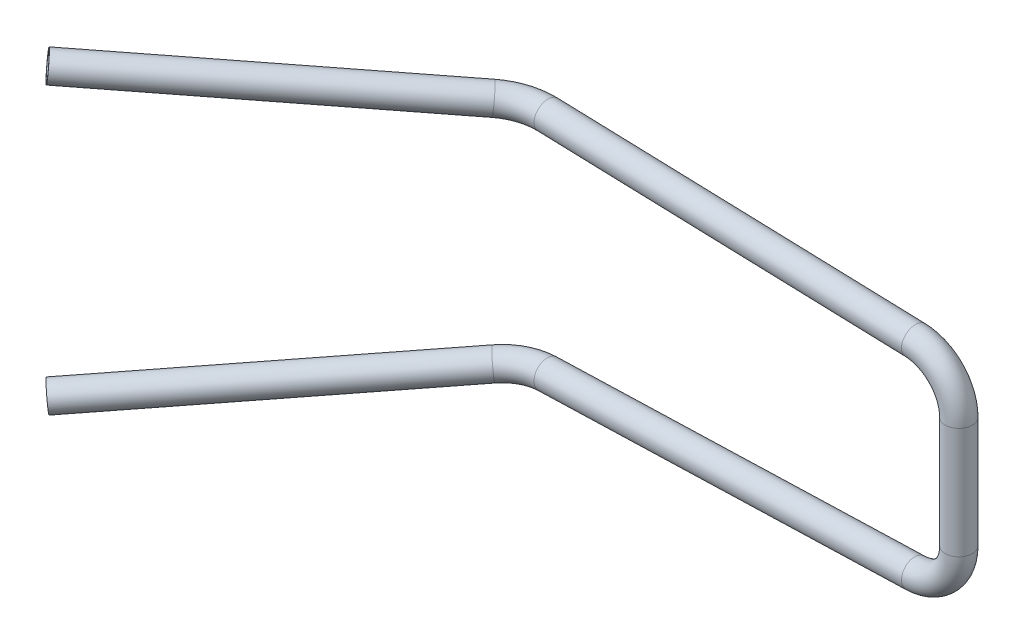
ISO-10303-21;
HEADER;
FILE_DESCRIPTION(('STEP AP214'),'2;1');
FILE_NAME('part.step','',(''),(''),'','','');
FILE_SCHEMA(('AUTOMOTIVE_DESIGN { 1 0 10303 214 1 1 1 1 }'));
ENDSEC;
DATA;
#1=APPLICATION_CONTEXT('core data for automotive mechanical design processes');
#2=APPLICATION_PROTOCOL_DEFINITION('international standard','automotive_design',2000,#1);
#3=PRODUCT_CONTEXT('',#1,'mechanical');
#4=PRODUCT('Part','Part','',(#3));
#5=PRODUCT_RELATED_PRODUCT_CATEGORY('part','',(#4));
#6=PRODUCT_DEFINITION_FORMATION('','',#4);
#7=PRODUCT_DEFINITION_CONTEXT('part definition',#1,'design');
#8=PRODUCT_DEFINITION('design','',#6,#7);
#9=PRODUCT_DEFINITION_SHAPE('','',#8);
#10=(LENGTH_UNIT() NAMED_UNIT(*) SI_UNIT(.MILLI.,.METRE.));
#11=(NAMED_UNIT(*) PLANE_ANGLE_UNIT() SI_UNIT($,.RADIAN.));
#12=(NAMED_UNIT(*) SI_UNIT($,.STERADIAN.) SOLID_ANGLE_UNIT());
#13=UNCERTAINTY_MEASURE_WITH_UNIT(LENGTH_MEASURE(1.E-05),#10,'distance_accuracy_value','');
#14=(GEOMETRIC_REPRESENTATION_CONTEXT(3) GLOBAL_UNCERTAINTY_ASSIGNED_CONTEXT((#13)) GLOBAL_UNIT_ASSIGNED_CONTEXT((#10,
#11,#12)) REPRESENTATION_CONTEXT('',''));
#15=CARTESIAN_POINT('',(0.,0.,0.));
#16=DIRECTION('',(0.,0.,1.));
#17=DIRECTION('',(1.,0.,0.));
#18=AXIS2_PLACEMENT_3D('',#15,#16,#17);
#19=CARTESIAN_POINT('',(-497.278865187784,-127.193748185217,17.4946720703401));
#20=DIRECTION('',(-0.704720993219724,-0.0882746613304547,0.703971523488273));
#21=DIRECTION('',(0.706730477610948,0.,0.707482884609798));
#22=AXIS2_PLACEMENT_3D('',#19,#20,#21);
#23=CYLINDRICAL_SURFACE('',#22,15.);
#24=CARTESIAN_POINT('',(-497.278865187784,-127.193748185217,17.4946720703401));
#25=DIRECTION('',(0.704720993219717,0.088274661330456,-0.703971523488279));
#26=DIRECTION('',(0.702774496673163,0.0492883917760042,0.709703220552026));
#27=AXIS2_PLACEMENT_3D('',#24,#25,#26);
#28=CIRCLE('',#27,15.);
#29=CARTESIAN_POINT('',(-507.910895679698,-126.532460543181,6.93424469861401));
#30=VERTEX_POINT('',#29);
#31=EDGE_CURVE('E39',#30,#30,#28,.T.);
#32=ORIENTED_EDGE('',*,*,#31,.F.);
#33=EDGE_LOOP('',(#32));
#34=FACE_BOUND('',#33,.T.);
#35=CARTESIAN_POINT('',(-743.931212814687,-158.089879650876,263.884705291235));
#36=DIRECTION('',(0.704720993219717,0.088274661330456,-0.703971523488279));
#37=DIRECTION('',(0.702774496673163,0.0492883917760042,0.709703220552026));
#38=AXIS2_PLACEMENT_3D('',#35,#36,#37);
#39=CIRCLE('',#38,15.);
#40=CARTESIAN_POINT('',(-733.389595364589,-157.350553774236,274.530253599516));
#41=VERTEX_POINT('',#40);
#42=EDGE_CURVE('E10',#41,#41,#39,.T.);
#43=ORIENTED_EDGE('',*,*,#42,.T.);
#44=EDGE_LOOP('',(#43));
#45=FACE_BOUND('',#44,.T.);
#46=ADVANCED_FACE('F29',(#34,#45),#23,.T.);
#47=CARTESIAN_POINT('',(-497.278865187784,-127.193748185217,17.4946720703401));
#48=DIRECTION('',(-0.704720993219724,-0.0882746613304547,0.703971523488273));
#49=DIRECTION('',(0.706730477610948,0.,0.707482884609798));
#50=AXIS2_PLACEMENT_3D('',#47,#48,#49);
#51=CYLINDRICAL_SURFACE('',#50,13.);
#52=CARTESIAN_POINT('',(-497.278865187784,-127.193748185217,17.4946720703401));
#53=DIRECTION('',(0.704720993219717,0.088274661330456,-0.703971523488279));
#54=DIRECTION('',(0.702774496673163,0.0492883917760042,0.709703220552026));
#55=AXIS2_PLACEMENT_3D('',#52,#53,#54);
#56=CIRCLE('',#55,13.);
#57=CARTESIAN_POINT('',(-506.493291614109,-126.620632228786,8.34230168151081));
#58=VERTEX_POINT('',#57);
#59=EDGE_CURVE('E43',#58,#58,#56,.T.);
#60=ORIENTED_EDGE('',*,*,#59,.T.);
#61=EDGE_LOOP('',(#60));
#62=FACE_BOUND('',#61,.T.);
#63=CARTESIAN_POINT('',(-743.931212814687,-158.089879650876,263.884705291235));
#64=DIRECTION('',(0.704720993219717,0.088274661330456,-0.703971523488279));
#65=DIRECTION('',(0.702774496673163,0.0492883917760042,0.709703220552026));
#66=AXIS2_PLACEMENT_3D('',#63,#64,#65);
#67=CIRCLE('',#66,13.);
#68=CARTESIAN_POINT('',(-734.795144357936,-157.449130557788,273.110847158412));
#69=VERTEX_POINT('',#68);
#70=EDGE_CURVE('E35',#69,#69,#67,.T.);
#71=ORIENTED_EDGE('',*,*,#70,.F.);
#72=EDGE_LOOP('',(#71));
#73=FACE_BOUND('',#72,.T.);
#74=ADVANCED_FACE('F143',(#62,#73),#51,.F.);
#75=CARTESIAN_POINT('',(-454.750743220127,-129.838898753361,59.7363815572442));
#76=DIRECTION('',(-0.031112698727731,0.995120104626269,0.0936374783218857));
#77=DIRECTION('',(0.,-0.0936828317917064,0.995602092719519));
#78=AXIS2_PLACEMENT_3D('',#75,#76,#77);
#79=TOROIDAL_SURFACE('',#78,60.,15.);
#80=CARTESIAN_POINT('',(-454.926313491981,-124.22339400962,0.));
#81=DIRECTION('',(0.999511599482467,0.0312500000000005,0.));
#82=DIRECTION('',(0.,0.,1.));
#83=AXIS2_PLACEMENT_3D('',#80,#81,#82);
#84=CIRCLE('',#83,15.);
#85=CARTESIAN_POINT('',(-454.970206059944,-122.819517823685,-14.9340953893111));
#86=VERTEX_POINT('',#85);
#87=EDGE_CURVE('E48',#86,#86,#84,.T.);
#88=CARTESIAN_POINT('',(-454.750743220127,-129.838898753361,59.7363815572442));
#89=DIRECTION('',(-0.031112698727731,0.995120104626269,0.0936374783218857));
#90=DIRECTION('',(0.,-0.0936828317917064,0.995602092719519));
#91=AXIS2_PLACEMENT_3D('',#88,#89,#90);
#92=CIRCLE('',#91,75.);
#93=EDGE_CURVE('',#86,#30,#92,.T.);
#94=ORIENTED_EDGE('',*,*,#87,.F.);
#95=ORIENTED_EDGE('',*,*,#31,.T.);
#96=ORIENTED_EDGE('',*,*,#93,.T.);
#97=ORIENTED_EDGE('',*,*,#93,.F.);
#98=EDGE_LOOP('',(#94,#96,#95,#97));
#99=FACE_BOUND('',#98,.T.);
#100=ADVANCED_FACE('F148',(#99),#79,.T.);
#101=CARTESIAN_POINT('',(-454.750743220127,-129.838898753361,59.7363815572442));
#102=DIRECTION('',(-0.031112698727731,0.995120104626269,0.0936374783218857));
#103=DIRECTION('',(0.,-0.0936828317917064,0.995602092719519));
#104=AXIS2_PLACEMENT_3D('',#101,#102,#103);
#105=TOROIDAL_SURFACE('',#104,60.,13.);
#106=CARTESIAN_POINT('',(-454.926313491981,-124.22339400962,0.));
#107=DIRECTION('',(0.999511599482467,0.0312500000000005,0.));
#108=DIRECTION('',(0.,0.,1.));
#109=AXIS2_PLACEMENT_3D('',#106,#107,#108);
#110=CIRCLE('',#109,13.);
#111=CARTESIAN_POINT('',(-454.964353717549,-123.006701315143,-12.9428826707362));
#112=VERTEX_POINT('',#111);
#113=EDGE_CURVE('E51',#112,#112,#110,.T.);
#114=CARTESIAN_POINT('',(-454.750743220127,-129.838898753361,59.7363815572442));
#115=DIRECTION('',(-0.031112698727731,0.995120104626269,0.0936374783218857));
#116=DIRECTION('',(0.,-0.0936828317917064,0.995602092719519));
#117=AXIS2_PLACEMENT_3D('',#114,#115,#116);
#118=CIRCLE('',#117,73.);
#119=EDGE_CURVE('',#112,#58,#118,.T.);
#120=ORIENTED_EDGE('',*,*,#113,.T.);
#121=ORIENTED_EDGE('',*,*,#59,.F.);
#122=ORIENTED_EDGE('',*,*,#119,.T.);
#123=ORIENTED_EDGE('',*,*,#119,.F.);
#124=EDGE_LOOP('',(#120,#122,#121,#123));
#125=FACE_BOUND('',#124,.T.);
#126=ADVANCED_FACE('F153',(#125),#105,.F.);
#127=CARTESIAN_POINT('',(-48.4375,-111.514411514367,0.));
#128=DIRECTION('',(-0.999511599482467,-0.03125,0.));
#129=DIRECTION('',(0.03125,-0.999511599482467,0.));
#130=AXIS2_PLACEMENT_3D('',#127,#128,#129);
#131=CYLINDRICAL_SURFACE('',#130,15.);
#132=CARTESIAN_POINT('',(-48.4375,-111.514411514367,0.));
#133=DIRECTION('',(0.999511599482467,0.0312500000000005,0.));
#134=DIRECTION('',(0.,0.,1.));
#135=AXIS2_PLACEMENT_3D('',#132,#133,#134);
#136=CIRCLE('',#135,15.);
#137=CARTESIAN_POINT('',(-47.96875,-126.507085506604,0.));
#138=VERTEX_POINT('',#137);
#139=EDGE_CURVE('E54',#138,#138,#136,.T.);
#140=ORIENTED_EDGE('',*,*,#139,.F.);
#141=EDGE_LOOP('',(#140));
#142=FACE_BOUND('',#141,.T.);
#143=ORIENTED_EDGE('',*,*,#87,.T.);
#144=EDGE_LOOP('',(#143));
#145=FACE_BOUND('',#144,.T.);
#146=ADVANCED_FACE('F159',(#142,#145),#131,.T.);
#147=CARTESIAN_POINT('',(-48.4375,-111.514411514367,0.));
#148=DIRECTION('',(-0.999511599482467,-0.03125,0.));
#149=DIRECTION('',(0.03125,-0.999511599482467,0.));
#150=AXIS2_PLACEMENT_3D('',#147,#148,#149);
#151=CYLINDRICAL_SURFACE('',#150,13.);
#152=CARTESIAN_POINT('',(-48.4375,-111.514411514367,0.));
#153=DIRECTION('',(0.999511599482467,0.0312500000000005,0.));
#154=DIRECTION('',(0.,0.,1.));
#155=AXIS2_PLACEMENT_3D('',#152,#153,#154);
#156=CIRCLE('',#155,13.);
#157=CARTESIAN_POINT('',(-48.03125,-124.508062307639,0.));
#158=VERTEX_POINT('',#157);
#159=EDGE_CURVE('E57',#158,#158,#156,.T.);
#160=ORIENTED_EDGE('',*,*,#159,.T.);
#161=EDGE_LOOP('',(#160));
#162=FACE_BOUND('',#161,.T.);
#163=ORIENTED_EDGE('',*,*,#113,.F.);
#164=EDGE_LOOP('',(#163));
#165=FACE_BOUND('',#164,.T.);
#166=ADVANCED_FACE('F166',(#162,#165),#151,.F.);
#167=CARTESIAN_POINT('',(-50.,-61.538831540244,0.));
#168=DIRECTION('',(0.,0.,-1.));
#169=DIRECTION('',(-1.,0.,0.));
#170=AXIS2_PLACEMENT_3D('',#167,#168,#169);
#171=TOROIDAL_SURFACE('',#170,50.,15.);
#172=CARTESIAN_POINT('',(0.,-61.538831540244,0.));
#173=DIRECTION('',(0.,1.,0.));
#174=DIRECTION('',(0.,0.,1.));
#175=AXIS2_PLACEMENT_3D('',#172,#173,#174);
#176=CIRCLE('',#175,15.);
#177=CARTESIAN_POINT('',(15.,-61.538831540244,0.));
#178=VERTEX_POINT('',#177);
#179=EDGE_CURVE('E60',#178,#178,#176,.T.);
#180=CARTESIAN_POINT('',(-50.,-61.538831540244,0.));
#181=DIRECTION('',(0.,0.,-1.));
#182=DIRECTION('',(-1.,0.,0.));
#183=AXIS2_PLACEMENT_3D('',#180,#181,#182);
#184=CIRCLE('',#183,65.);
#185=EDGE_CURVE('',#178,#138,#184,.T.);
#186=ORIENTED_EDGE('',*,*,#179,.F.);
#187=ORIENTED_EDGE('',*,*,#139,.T.);
#188=ORIENTED_EDGE('',*,*,#185,.T.);
#189=ORIENTED_EDGE('',*,*,#185,.F.);
#190=EDGE_LOOP('',(#186,#188,#187,#189));
#191=FACE_BOUND('',#190,.T.);
#192=ADVANCED_FACE('F170',(#191),#171,.T.);
#193=CARTESIAN_POINT('',(-50.,-61.538831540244,0.));
#194=DIRECTION('',(0.,0.,-1.));
#195=DIRECTION('',(-1.,0.,0.));
#196=AXIS2_PLACEMENT_3D('',#193,#194,#195);
#197=TOROIDAL_SURFACE('',#196,50.,13.);
#198=CARTESIAN_POINT('',(0.,-61.538831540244,0.));
#199=DIRECTION('',(0.,1.,0.));
#200=DIRECTION('',(0.,0.,1.));
#201=AXIS2_PLACEMENT_3D('',#198,#199,#200);
#202=CIRCLE('',#201,13.);
#203=CARTESIAN_POINT('',(13.,-61.538831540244,0.));
#204=VERTEX_POINT('',#203);
#205=EDGE_CURVE('E63',#204,#204,#202,.T.);
#206=CARTESIAN_POINT('',(-50.,-61.538831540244,0.));
#207=DIRECTION('',(0.,0.,-1.));
#208=DIRECTION('',(-1.,0.,0.));
#209=AXIS2_PLACEMENT_3D('',#206,#207,#208);
#210=CIRCLE('',#209,63.);
#211=EDGE_CURVE('',#204,#158,#210,.T.);
#212=ORIENTED_EDGE('',*,*,#205,.T.);
#213=ORIENTED_EDGE('',*,*,#159,.F.);
#214=ORIENTED_EDGE('',*,*,#211,.T.);
#215=ORIENTED_EDGE('',*,*,#211,.F.);
#216=EDGE_LOOP('',(#212,#214,#213,#215));
#217=FACE_BOUND('',#216,.T.);
#218=ADVANCED_FACE('F174',(#217),#197,.F.);
#219=CARTESIAN_POINT('',(0.,-61.538831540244,0.));
#220=DIRECTION('',(0.,1.,0.));
#221=DIRECTION('',(-1.,0.,0.));
#222=AXIS2_PLACEMENT_3D('',#219,#220,#221);
#223=CYLINDRICAL_SURFACE('',#222,13.);
#224=ORIENTED_EDGE('',*,*,#205,.F.);
#225=EDGE_LOOP('',(#224));
#226=FACE_BOUND('',#225,.T.);
#227=CARTESIAN_POINT('',(0.,61.538831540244,0.));
#228=DIRECTION('',(0.,1.,0.));
#229=DIRECTION('',(0.,0.,1.));
#230=AXIS2_PLACEMENT_3D('',#227,#228,#229);
#231=CIRCLE('',#230,13.);
#232=CARTESIAN_POINT('',(13.,61.538831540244,0.));
#233=VERTEX_POINT('',#232);
#234=EDGE_CURVE('E93',#233,#233,#231,.T.);
#235=ORIENTED_EDGE('',*,*,#234,.T.);
#236=EDGE_LOOP('',(#235));
#237=FACE_BOUND('',#236,.T.);
#238=ADVANCED_FACE('F97',(#226,#237),#223,.F.);
#239=CARTESIAN_POINT('',(0.,-61.538831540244,0.));
#240=DIRECTION('',(0.,1.,0.));
#241=DIRECTION('',(-1.,0.,0.));
#242=AXIS2_PLACEMENT_3D('',#239,#240,#241);
#243=CYLINDRICAL_SURFACE('',#242,15.);
#244=ORIENTED_EDGE('',*,*,#179,.T.);
#245=EDGE_LOOP('',(#244));
#246=FACE_BOUND('',#245,.T.);
#247=CARTESIAN_POINT('',(0.,61.538831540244,0.));
#248=DIRECTION('',(0.,1.,0.));
#249=DIRECTION('',(0.,0.,1.));
#250=AXIS2_PLACEMENT_3D('',#247,#248,#249);
#251=CIRCLE('',#250,15.);
#252=CARTESIAN_POINT('',(15.,61.538831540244,0.));
#253=VERTEX_POINT('',#252);
#254=EDGE_CURVE('E90',#253,#253,#251,.T.);
#255=ORIENTED_EDGE('',*,*,#254,.F.);
#256=EDGE_LOOP('',(#255));
#257=FACE_BOUND('',#256,.T.);
#258=ADVANCED_FACE('F140',(#246,#257),#243,.T.);
#259=CARTESIAN_POINT('',(-743.931212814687,-158.089879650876,263.884705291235));
#260=DIRECTION('',(0.704720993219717,0.088274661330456,-0.703971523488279));
#261=DIRECTION('',(0.702774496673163,0.0492883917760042,0.709703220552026));
#262=AXIS2_PLACEMENT_3D('',#259,#260,#261);
#263=PLANE('',#262);
#264=ORIENTED_EDGE('',*,*,#70,.T.);
#265=EDGE_LOOP('',(#264));
#266=FACE_BOUND('',#265,.T.);
#267=ORIENTED_EDGE('',*,*,#42,.F.);
#268=EDGE_LOOP('',(#267));
#269=FACE_BOUND('',#268,.T.);
#270=ADVANCED_FACE('F134',(#266,#269),#263,.F.);
#271=CARTESIAN_POINT('',(-497.278865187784,127.193748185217,17.4946720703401));
#272=DIRECTION('',(-0.704720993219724,0.0882746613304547,0.703971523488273));
#273=DIRECTION('',(0.706730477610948,0.,0.707482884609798));
#274=AXIS2_PLACEMENT_3D('',#271,#272,#273);
#275=CYLINDRICAL_SURFACE('',#274,15.);
#276=CARTESIAN_POINT('',(-497.278865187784,127.193748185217,17.4946720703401));
#277=DIRECTION('',(-0.704720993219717,0.088274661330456,0.703971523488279));
#278=DIRECTION('',(0.702774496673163,-0.0492883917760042,0.709703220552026));
#279=AXIS2_PLACEMENT_3D('',#276,#277,#278);
#280=CIRCLE('',#279,15.);
#281=CARTESIAN_POINT('',(-507.910895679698,126.532460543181,6.93424469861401));
#282=VERTEX_POINT('',#281);
#283=EDGE_CURVE('E72',#282,#282,#280,.T.);
#284=ORIENTED_EDGE('',*,*,#283,.T.);
#285=EDGE_LOOP('',(#284));
#286=FACE_BOUND('',#285,.T.);
#287=CARTESIAN_POINT('',(-743.931212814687,158.089879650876,263.884705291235));
#288=DIRECTION('',(-0.704720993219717,0.088274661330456,0.703971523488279));
#289=DIRECTION('',(0.702774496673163,-0.0492883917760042,0.709703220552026));
#290=AXIS2_PLACEMENT_3D('',#287,#288,#289);
#291=CIRCLE('',#290,15.);
#292=CARTESIAN_POINT('',(-733.389595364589,157.350553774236,274.530253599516));
#293=VERTEX_POINT('',#292);
#294=EDGE_CURVE('E66',#293,#293,#291,.T.);
#295=ORIENTED_EDGE('',*,*,#294,.F.);
#296=EDGE_LOOP('',(#295));
#297=FACE_BOUND('',#296,.T.);
#298=ADVANCED_FACE('F124',(#286,#297),#275,.T.);
#299=CARTESIAN_POINT('',(-497.278865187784,127.193748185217,17.4946720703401));
#300=DIRECTION('',(-0.704720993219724,0.0882746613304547,0.703971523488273));
#301=DIRECTION('',(0.706730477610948,0.,0.707482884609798));
#302=AXIS2_PLACEMENT_3D('',#299,#300,#301);
#303=CYLINDRICAL_SURFACE('',#302,13.);
#304=CARTESIAN_POINT('',(-497.278865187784,127.193748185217,17.4946720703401));
#305=DIRECTION('',(-0.704720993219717,0.088274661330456,0.703971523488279));
#306=DIRECTION('',(0.702774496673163,-0.0492883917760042,0.709703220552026));
#307=AXIS2_PLACEMENT_3D('',#304,#305,#306);
#308=CIRCLE('',#307,13.);
#309=CARTESIAN_POINT('',(-506.493291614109,126.620632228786,8.34230168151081));
#310=VERTEX_POINT('',#309);
#311=EDGE_CURVE('E75',#310,#310,#308,.T.);
#312=ORIENTED_EDGE('',*,*,#311,.F.);
#313=EDGE_LOOP('',(#312));
#314=FACE_BOUND('',#313,.T.);
#315=CARTESIAN_POINT('',(-743.931212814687,158.089879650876,263.884705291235));
#316=DIRECTION('',(-0.704720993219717,0.088274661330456,0.703971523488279));
#317=DIRECTION('',(0.702774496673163,-0.0492883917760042,0.709703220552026));
#318=AXIS2_PLACEMENT_3D('',#315,#316,#317);
#319=CIRCLE('',#318,13.);
#320=CARTESIAN_POINT('',(-734.795144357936,157.449130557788,273.110847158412));
#321=VERTEX_POINT('',#320);
#322=EDGE_CURVE('E69',#321,#321,#319,.T.);
#323=ORIENTED_EDGE('',*,*,#322,.T.);
#324=EDGE_LOOP('',(#323));
#325=FACE_BOUND('',#324,.T.);
#326=ADVANCED_FACE('F121',(#314,#325),#303,.F.);
#327=CARTESIAN_POINT('',(-454.750743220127,129.838898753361,59.7363815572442));
#328=DIRECTION('',(0.031112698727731,0.995120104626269,-0.0936374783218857));
#329=DIRECTION('',(0.,0.0936828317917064,0.995602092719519));
#330=AXIS2_PLACEMENT_3D('',#327,#328,#329);
#331=TOROIDAL_SURFACE('',#330,60.,15.);
#332=CARTESIAN_POINT('',(-454.926313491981,124.22339400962,0.));
#333=DIRECTION('',(-0.999511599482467,0.0312500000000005,0.));
#334=DIRECTION('',(0.,0.,1.));
#335=AXIS2_PLACEMENT_3D('',#332,#333,#334);
#336=CIRCLE('',#335,15.);
#337=CARTESIAN_POINT('',(-454.970206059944,122.819517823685,-14.9340953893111));
#338=VERTEX_POINT('',#337);
#339=EDGE_CURVE('E78',#338,#338,#336,.T.);
#340=CARTESIAN_POINT('',(-454.750743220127,129.838898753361,59.7363815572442));
#341=DIRECTION('',(0.031112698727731,0.995120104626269,-0.0936374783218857));
#342=DIRECTION('',(0.,0.0936828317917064,0.995602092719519));
#343=AXIS2_PLACEMENT_3D('',#340,#341,#342);
#344=CIRCLE('',#343,75.);
#345=EDGE_CURVE('',#338,#282,#344,.T.);
#346=ORIENTED_EDGE('',*,*,#339,.T.);
#347=ORIENTED_EDGE('',*,*,#283,.F.);
#348=ORIENTED_EDGE('',*,*,#345,.T.);
#349=ORIENTED_EDGE('',*,*,#345,.F.);
#350=EDGE_LOOP('',(#346,#348,#347,#349));
#351=FACE_BOUND('',#350,.T.);
#352=ADVANCED_FACE('F117',(#351),#331,.T.);
#353=CARTESIAN_POINT('',(-454.750743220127,129.838898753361,59.7363815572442));
#354=DIRECTION('',(0.031112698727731,0.995120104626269,-0.0936374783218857));
#355=DIRECTION('',(0.,0.0936828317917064,0.995602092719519));
#356=AXIS2_PLACEMENT_3D('',#353,#354,#355);
#357=TOROIDAL_SURFACE('',#356,60.,13.);
#358=CARTESIAN_POINT('',(-454.926313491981,124.22339400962,0.));
#359=DIRECTION('',(-0.999511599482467,0.0312500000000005,0.));
#360=DIRECTION('',(0.,0.,1.));
#361=AXIS2_PLACEMENT_3D('',#358,#359,#360);
#362=CIRCLE('',#361,13.);
#363=CARTESIAN_POINT('',(-454.964353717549,123.006701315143,-12.9428826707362));
#364=VERTEX_POINT('',#363);
#365=EDGE_CURVE('E81',#364,#364,#362,.T.);
#366=CARTESIAN_POINT('',(-454.750743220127,129.838898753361,59.7363815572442));
#367=DIRECTION('',(0.031112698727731,0.995120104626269,-0.0936374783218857));
#368=DIRECTION('',(0.,0.0936828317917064,0.995602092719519));
#369=AXIS2_PLACEMENT_3D('',#366,#367,#368);
#370=CIRCLE('',#369,73.);
#371=EDGE_CURVE('',#364,#310,#370,.T.);
#372=ORIENTED_EDGE('',*,*,#365,.F.);
#373=ORIENTED_EDGE('',*,*,#311,.T.);
#374=ORIENTED_EDGE('',*,*,#371,.T.);
#375=ORIENTED_EDGE('',*,*,#371,.F.);
#376=EDGE_LOOP('',(#372,#374,#373,#375));
#377=FACE_BOUND('',#376,.T.);
#378=ADVANCED_FACE('F114',(#377),#357,.F.);
#379=CARTESIAN_POINT('',(-48.4375,111.514411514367,0.));
#380=DIRECTION('',(-0.999511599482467,0.03125,0.));
#381=DIRECTION('',(-0.03125,-0.999511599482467,0.));
#382=AXIS2_PLACEMENT_3D('',#379,#380,#381);
#383=CYLINDRICAL_SURFACE('',#382,15.);
#384=CARTESIAN_POINT('',(-48.4375,111.514411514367,0.));
#385=DIRECTION('',(-0.999511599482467,0.0312500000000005,0.));
#386=DIRECTION('',(0.,0.,1.));
#387=AXIS2_PLACEMENT_3D('',#384,#385,#386);
#388=CIRCLE('',#387,15.);
#389=CARTESIAN_POINT('',(-47.96875,126.507085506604,0.));
#390=VERTEX_POINT('',#389);
#391=EDGE_CURVE('E84',#390,#390,#388,.T.);
#392=ORIENTED_EDGE('',*,*,#391,.T.);
#393=EDGE_LOOP('',(#392));
#394=FACE_BOUND('',#393,.T.);
#395=ORIENTED_EDGE('',*,*,#339,.F.);
#396=EDGE_LOOP('',(#395));
#397=FACE_BOUND('',#396,.T.);
#398=ADVANCED_FACE('F110',(#394,#397),#383,.T.);
#399=CARTESIAN_POINT('',(-48.4375,111.514411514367,0.));
#400=DIRECTION('',(-0.999511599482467,0.03125,0.));
#401=DIRECTION('',(-0.03125,-0.999511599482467,0.));
#402=AXIS2_PLACEMENT_3D('',#399,#400,#401);
#403=CYLINDRICAL_SURFACE('',#402,13.);
#404=CARTESIAN_POINT('',(-48.4375,111.514411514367,0.));
#405=DIRECTION('',(-0.999511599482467,0.0312500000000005,0.));
#406=DIRECTION('',(0.,0.,1.));
#407=AXIS2_PLACEMENT_3D('',#404,#405,#406);
#408=CIRCLE('',#407,13.);
#409=CARTESIAN_POINT('',(-48.03125,124.508062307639,0.));
#410=VERTEX_POINT('',#409);
#411=EDGE_CURVE('E87',#410,#410,#408,.T.);
#412=ORIENTED_EDGE('',*,*,#411,.F.);
#413=EDGE_LOOP('',(#412));
#414=FACE_BOUND('',#413,.T.);
#415=ORIENTED_EDGE('',*,*,#365,.T.);
#416=EDGE_LOOP('',(#415));
#417=FACE_BOUND('',#416,.T.);
#418=ADVANCED_FACE('F107',(#414,#417),#403,.F.);
#419=CARTESIAN_POINT('',(-50.,61.538831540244,0.));
#420=DIRECTION('',(0.,0.,1.));
#421=DIRECTION('',(1.,0.,0.));
#422=AXIS2_PLACEMENT_3D('',#419,#420,#421);
#423=TOROIDAL_SURFACE('',#422,50.,15.);
#424=CARTESIAN_POINT('',(-50.,61.538831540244,0.));
#425=DIRECTION('',(0.,0.,1.));
#426=DIRECTION('',(1.,0.,0.));
#427=AXIS2_PLACEMENT_3D('',#424,#425,#426);
#428=CIRCLE('',#427,65.);
#429=EDGE_CURVE('',#253,#390,#428,.T.);
#430=ORIENTED_EDGE('',*,*,#254,.T.);
#431=ORIENTED_EDGE('',*,*,#391,.F.);
#432=ORIENTED_EDGE('',*,*,#429,.T.);
#433=ORIENTED_EDGE('',*,*,#429,.F.);
#434=EDGE_LOOP('',(#430,#432,#431,#433));
#435=FACE_BOUND('',#434,.T.);
#436=ADVANCED_FACE('F103',(#435),#423,.T.);
#437=CARTESIAN_POINT('',(-50.,61.538831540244,0.));
#438=DIRECTION('',(0.,0.,1.));
#439=DIRECTION('',(1.,0.,0.));
#440=AXIS2_PLACEMENT_3D('',#437,#438,#439);
#441=TOROIDAL_SURFACE('',#440,50.,13.);
#442=CARTESIAN_POINT('',(-50.,61.538831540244,0.));
#443=DIRECTION('',(0.,0.,1.));
#444=DIRECTION('',(1.,0.,0.));
#445=AXIS2_PLACEMENT_3D('',#442,#443,#444);
#446=CIRCLE('',#445,63.);
#447=EDGE_CURVE('',#233,#410,#446,.T.);
#448=ORIENTED_EDGE('',*,*,#234,.F.);
#449=ORIENTED_EDGE('',*,*,#411,.T.);
#450=ORIENTED_EDGE('',*,*,#447,.T.);
#451=ORIENTED_EDGE('',*,*,#447,.F.);
#452=EDGE_LOOP('',(#448,#450,#449,#451));
#453=FACE_BOUND('',#452,.T.);
#454=ADVANCED_FACE('F99',(#453),#441,.F.);
#455=CARTESIAN_POINT('',(-743.931212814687,158.089879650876,263.884705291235));
#456=DIRECTION('',(0.704720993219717,-0.088274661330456,-0.703971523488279));
#457=DIRECTION('',(0.702774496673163,-0.0492883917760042,0.709703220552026));
#458=AXIS2_PLACEMENT_3D('',#455,#456,#457);
#459=PLANE('',#458);
#460=ORIENTED_EDGE('',*,*,#322,.F.);
#461=EDGE_LOOP('',(#460));
#462=FACE_BOUND('',#461,.T.);
#463=ORIENTED_EDGE('',*,*,#294,.T.);
#464=EDGE_LOOP('',(#463));
#465=FACE_BOUND('',#464,.T.);
#466=ADVANCED_FACE('F102',(#462,#465),#459,.F.);
#467=CLOSED_SHELL('',(#46,#74,#100,#126,#146,#166,#192,#218,#238,#258,#270,#298,#326,#352,#378,
#398,#418,#436,#454,#466));
#468=MANIFOLD_SOLID_BREP('B2',#467);
#469=ADVANCED_BREP_SHAPE_REPRESENTATION('',(#18,#468),#14);
#470=SHAPE_DEFINITION_REPRESENTATION(#9,#469);
ENDSEC;
END-ISO-10303-21;
